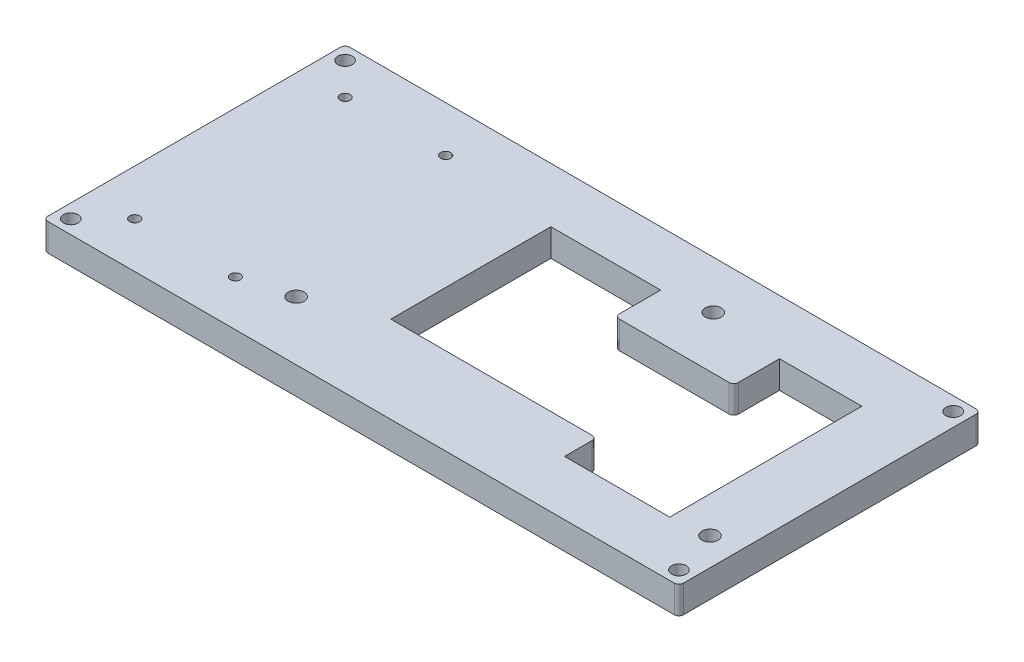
ISO-10303-21;
HEADER;
FILE_DESCRIPTION(('STEP AP214'),'2;1');
FILE_NAME('part.step','',(''),(''),'','','');
FILE_SCHEMA(('AUTOMOTIVE_DESIGN { 1 0 10303 214 1 1 1 1 }'));
ENDSEC;
DATA;
#1=APPLICATION_CONTEXT('core data for automotive mechanical design processes');
#2=APPLICATION_PROTOCOL_DEFINITION('international standard','automotive_design',2000,#1);
#3=PRODUCT_CONTEXT('',#1,'mechanical');
#4=PRODUCT('Part','Part','',(#3));
#5=PRODUCT_RELATED_PRODUCT_CATEGORY('part','',(#4));
#6=PRODUCT_DEFINITION_FORMATION('','',#4);
#7=PRODUCT_DEFINITION_CONTEXT('part definition',#1,'design');
#8=PRODUCT_DEFINITION('design','',#6,#7);
#9=PRODUCT_DEFINITION_SHAPE('','',#8);
#10=(LENGTH_UNIT() NAMED_UNIT(*) SI_UNIT(.MILLI.,.METRE.));
#11=(NAMED_UNIT(*) PLANE_ANGLE_UNIT() SI_UNIT($,.RADIAN.));
#12=(NAMED_UNIT(*) SI_UNIT($,.STERADIAN.) SOLID_ANGLE_UNIT());
#13=UNCERTAINTY_MEASURE_WITH_UNIT(LENGTH_MEASURE(1.E-05),#10,'distance_accuracy_value','');
#14=(GEOMETRIC_REPRESENTATION_CONTEXT(3) GLOBAL_UNCERTAINTY_ASSIGNED_CONTEXT((#13)) GLOBAL_UNIT_ASSIGNED_CONTEXT((#10,
#11,#12)) REPRESENTATION_CONTEXT('',''));
#15=CARTESIAN_POINT('',(0.,0.,0.));
#16=DIRECTION('',(0.,0.,1.));
#17=DIRECTION('',(1.,0.,0.));
#18=AXIS2_PLACEMENT_3D('',#15,#16,#17);
#19=CARTESIAN_POINT('',(91.,6.,-55.5));
#20=DIRECTION('',(0.,-1.,0.));
#21=DIRECTION('',(0.,0.,-1.));
#22=AXIS2_PLACEMENT_3D('',#19,#20,#21);
#23=CYLINDRICAL_SURFACE('',#22,1.75);
#24=CARTESIAN_POINT('',(91.,6.,-55.5));
#25=DIRECTION('',(0.,1.,0.));
#26=DIRECTION('',(0.,0.,1.));
#27=AXIS2_PLACEMENT_3D('',#24,#25,#26);
#28=CIRCLE('',#27,1.75);
#29=CARTESIAN_POINT('',(91.,6.,-53.75));
#30=VERTEX_POINT('',#29);
#31=EDGE_CURVE('E335',#30,#30,#28,.T.);
#32=ORIENTED_EDGE('',*,*,#31,.T.);
#33=EDGE_LOOP('',(#32));
#34=FACE_BOUND('',#33,.T.);
#35=CARTESIAN_POINT('',(91.,3.,-55.5));
#36=DIRECTION('',(0.,-1.,0.));
#37=DIRECTION('',(0.,0.,-1.));
#38=AXIS2_PLACEMENT_3D('',#35,#36,#37);
#39=CIRCLE('',#38,1.75);
#40=CARTESIAN_POINT('',(91.,3.,-57.25));
#41=VERTEX_POINT('',#40);
#42=EDGE_CURVE('E35',#41,#41,#39,.T.);
#43=ORIENTED_EDGE('',*,*,#42,.T.);
#44=EDGE_LOOP('',(#43));
#45=FACE_BOUND('',#44,.T.);
#46=ADVANCED_FACE('F31',(#34,#45),#23,.F.);
#47=CARTESIAN_POINT('',(42.4,6.,-12.9));
#48=DIRECTION('',(0.,-1.,0.));
#49=DIRECTION('',(0.,0.,-1.));
#50=AXIS2_PLACEMENT_3D('',#47,#48,#49);
#51=CYLINDRICAL_SURFACE('',#50,1.75);
#52=CARTESIAN_POINT('',(42.4,6.,-12.9));
#53=DIRECTION('',(0.,1.,0.));
#54=DIRECTION('',(0.,0.,1.));
#55=AXIS2_PLACEMENT_3D('',#52,#53,#54);
#56=CIRCLE('',#55,1.75);
#57=CARTESIAN_POINT('',(42.4,6.,-11.15));
#58=VERTEX_POINT('',#57);
#59=EDGE_CURVE('E387',#58,#58,#56,.T.);
#60=ORIENTED_EDGE('',*,*,#59,.T.);
#61=EDGE_LOOP('',(#60));
#62=FACE_BOUND('',#61,.T.);
#63=CARTESIAN_POINT('',(42.4,3.,-12.9));
#64=DIRECTION('',(0.,-1.,0.));
#65=DIRECTION('',(0.,0.,-1.));
#66=AXIS2_PLACEMENT_3D('',#63,#64,#65);
#67=CIRCLE('',#66,1.75);
#68=CARTESIAN_POINT('',(42.4,3.,-14.65));
#69=VERTEX_POINT('',#68);
#70=EDGE_CURVE('E337',#69,#69,#67,.T.);
#71=ORIENTED_EDGE('',*,*,#70,.T.);
#72=EDGE_LOOP('',(#71));
#73=FACE_BOUND('',#72,.T.);
#74=ADVANCED_FACE('F432',(#62,#73),#51,.F.);
#75=CARTESIAN_POINT('',(132.9,6.,-12.9));
#76=DIRECTION('',(0.,-1.,0.));
#77=DIRECTION('',(0.,0.,-1.));
#78=AXIS2_PLACEMENT_3D('',#75,#76,#77);
#79=CYLINDRICAL_SURFACE('',#78,1.75000000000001);
#80=CARTESIAN_POINT('',(132.9,6.,-12.9));
#81=DIRECTION('',(0.,1.,0.));
#82=DIRECTION('',(0.,0.,1.));
#83=AXIS2_PLACEMENT_3D('',#80,#81,#82);
#84=CIRCLE('',#83,1.75000000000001);
#85=CARTESIAN_POINT('',(132.9,6.,-11.15));
#86=VERTEX_POINT('',#85);
#87=EDGE_CURVE('E382',#86,#86,#84,.T.);
#88=ORIENTED_EDGE('',*,*,#87,.T.);
#89=EDGE_LOOP('',(#88));
#90=FACE_BOUND('',#89,.T.);
#91=CARTESIAN_POINT('',(132.9,3.,-12.9));
#92=DIRECTION('',(0.,-1.,0.));
#93=DIRECTION('',(0.,0.,-1.));
#94=AXIS2_PLACEMENT_3D('',#91,#92,#93);
#95=CIRCLE('',#94,1.75000000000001);
#96=CARTESIAN_POINT('',(132.9,3.,-14.65));
#97=VERTEX_POINT('',#96);
#98=EDGE_CURVE('E333',#97,#97,#95,.T.);
#99=ORIENTED_EDGE('',*,*,#98,.T.);
#100=EDGE_LOOP('',(#99));
#101=FACE_BOUND('',#100,.T.);
#102=ADVANCED_FACE('F438',(#90,#101),#79,.F.);
#103=CARTESIAN_POINT('',(1.,6.,-1.));
#104=DIRECTION('',(0.,-1.,0.));
#105=DIRECTION('',(0.,0.,-1.));
#106=AXIS2_PLACEMENT_3D('',#103,#104,#105);
#107=PLANE('',#106);
#108=CARTESIAN_POINT('',(3.,6.,-63.));
#109=DIRECTION('',(0.,1.,0.));
#110=DIRECTION('',(0.,0.,-1.));
#111=AXIS2_PLACEMENT_3D('',#108,#109,#110);
#112=CIRCLE('',#111,1.6);
#113=CARTESIAN_POINT('',(3.,6.,-64.6));
#114=VERTEX_POINT('',#113);
#115=EDGE_CURVE('E361',#114,#114,#112,.T.);
#116=ORIENTED_EDGE('',*,*,#115,.F.);
#117=EDGE_LOOP('',(#116));
#118=FACE_BOUND('',#117,.T.);
#119=CARTESIAN_POINT('',(3.,6.,-3.));
#120=DIRECTION('',(0.,1.,0.));
#121=DIRECTION('',(0.,0.,1.));
#122=AXIS2_PLACEMENT_3D('',#119,#120,#121);
#123=CIRCLE('',#122,1.6);
#124=CARTESIAN_POINT('',(3.,6.,-1.4));
#125=VERTEX_POINT('',#124);
#126=EDGE_CURVE('E373',#125,#125,#123,.T.);
#127=ORIENTED_EDGE('',*,*,#126,.F.);
#128=EDGE_LOOP('',(#127));
#129=FACE_BOUND('',#128,.T.);
#130=ORIENTED_EDGE('',*,*,#87,.F.);
#131=EDGE_LOOP('',(#130));
#132=FACE_BOUND('',#131,.T.);
#133=CARTESIAN_POINT('',(32.,6.,-56.));
#134=DIRECTION('',(0.,1.,0.));
#135=DIRECTION('',(0.,0.,-1.));
#136=AXIS2_PLACEMENT_3D('',#133,#134,#135);
#137=CIRCLE('',#136,1.1);
#138=CARTESIAN_POINT('',(32.,6.,-57.1));
#139=VERTEX_POINT('',#138);
#140=EDGE_CURVE('E391',#139,#139,#137,.T.);
#141=ORIENTED_EDGE('',*,*,#140,.F.);
#142=EDGE_LOOP('',(#141));
#143=FACE_BOUND('',#142,.T.);
#144=CARTESIAN_POINT('',(10.,6.,-10.));
#145=DIRECTION('',(0.,1.,0.));
#146=DIRECTION('',(0.,0.,1.));
#147=AXIS2_PLACEMENT_3D('',#144,#145,#146);
#148=CIRCLE('',#147,1.1);
#149=CARTESIAN_POINT('',(10.,6.,-8.9));
#150=VERTEX_POINT('',#149);
#151=EDGE_CURVE('E403',#150,#150,#148,.T.);
#152=ORIENTED_EDGE('',*,*,#151,.F.);
#153=EDGE_LOOP('',(#152));
#154=FACE_BOUND('',#153,.T.);
#155=CARTESIAN_POINT('',(101.,6.,-18.));
#156=DIRECTION('',(0.,-1.,0.));
#157=DIRECTION('',(0.,0.,1.));
#158=AXIS2_PLACEMENT_3D('',#155,#156,#157);
#159=CIRCLE('',#158,1.);
#160=CARTESIAN_POINT('',(101.,6.,-19.));
#161=VERTEX_POINT('',#160);
#162=CARTESIAN_POINT('',(102.,6.,-18.));
#163=VERTEX_POINT('',#162);
#164=EDGE_CURVE('E176',#161,#163,#159,.T.);
#165=ORIENTED_EDGE('',*,*,#164,.F.);
#166=DIRECTION('',(1.,0.,0.));
#167=VECTOR('',#166,1.);
#168=CARTESIAN_POINT('',(57.,6.,-19.));
#169=LINE('',#168,#167);
#170=CARTESIAN_POINT('',(57.,6.,-19.));
#171=VERTEX_POINT('',#170);
#172=EDGE_CURVE('E222',#171,#161,#169,.T.);
#173=ORIENTED_EDGE('',*,*,#172,.F.);
#174=DIRECTION('',(0.,0.,1.));
#175=VECTOR('',#174,1.);
#176=CARTESIAN_POINT('',(57.,6.,-19.));
#177=LINE('',#176,#175);
#178=CARTESIAN_POINT('',(57.,6.,-54.));
#179=VERTEX_POINT('',#178);
#180=EDGE_CURVE('E220',#179,#171,#177,.T.);
#181=ORIENTED_EDGE('',*,*,#180,.F.);
#182=DIRECTION('',(-1.,0.,0.));
#183=VECTOR('',#182,1.);
#184=CARTESIAN_POINT('',(81.,6.,-54.));
#185=LINE('',#184,#183);
#186=CARTESIAN_POINT('',(81.,6.,-54.));
#187=VERTEX_POINT('',#186);
#188=EDGE_CURVE('E218',#187,#179,#185,.T.);
#189=ORIENTED_EDGE('',*,*,#188,.F.);
#190=DIRECTION('',(0.,0.,-1.));
#191=VECTOR('',#190,1.);
#192=CARTESIAN_POINT('',(81.,6.,-54.));
#193=LINE('',#192,#191);
#194=CARTESIAN_POINT('',(81.,6.,-45.));
#195=VERTEX_POINT('',#194);
#196=EDGE_CURVE('E216',#195,#187,#193,.T.);
#197=ORIENTED_EDGE('',*,*,#196,.F.);
#198=CARTESIAN_POINT('',(82.,6.,-45.));
#199=DIRECTION('',(0.,-1.,0.));
#200=DIRECTION('',(0.,0.,1.));
#201=AXIS2_PLACEMENT_3D('',#198,#199,#200);
#202=CIRCLE('',#201,1.);
#203=CARTESIAN_POINT('',(82.,6.,-44.));
#204=VERTEX_POINT('',#203);
#205=EDGE_CURVE('E214',#204,#195,#202,.T.);
#206=ORIENTED_EDGE('',*,*,#205,.F.);
#207=DIRECTION('',(-1.,0.,0.));
#208=VECTOR('',#207,1.);
#209=CARTESIAN_POINT('',(82.,6.,-44.));
#210=LINE('',#209,#208);
#211=CARTESIAN_POINT('',(106.,6.,-44.));
#212=VERTEX_POINT('',#211);
#213=EDGE_CURVE('E212',#212,#204,#210,.T.);
#214=ORIENTED_EDGE('',*,*,#213,.F.);
#215=CARTESIAN_POINT('',(106.,6.,-45.));
#216=DIRECTION('',(0.,-1.,0.));
#217=DIRECTION('',(0.,0.,1.));
#218=AXIS2_PLACEMENT_3D('',#215,#216,#217);
#219=CIRCLE('',#218,1.);
#220=CARTESIAN_POINT('',(107.,6.,-45.));
#221=VERTEX_POINT('',#220);
#222=EDGE_CURVE('E210',#221,#212,#219,.T.);
#223=ORIENTED_EDGE('',*,*,#222,.F.);
#224=DIRECTION('',(0.,0.,1.));
#225=VECTOR('',#224,1.);
#226=CARTESIAN_POINT('',(107.,6.,-45.));
#227=LINE('',#226,#225);
#228=CARTESIAN_POINT('',(107.,6.,-54.));
#229=VERTEX_POINT('',#228);
#230=EDGE_CURVE('E208',#229,#221,#227,.T.);
#231=ORIENTED_EDGE('',*,*,#230,.F.);
#232=DIRECTION('',(-1.,0.,0.));
#233=VECTOR('',#232,1.);
#234=CARTESIAN_POINT('',(125.,6.,-54.));
#235=LINE('',#234,#233);
#236=CARTESIAN_POINT('',(125.,6.,-54.));
#237=VERTEX_POINT('',#236);
#238=EDGE_CURVE('E206',#237,#229,#235,.T.);
#239=ORIENTED_EDGE('',*,*,#238,.F.);
#240=DIRECTION('',(0.,0.,-1.));
#241=VECTOR('',#240,1.);
#242=CARTESIAN_POINT('',(125.,6.,-12.));
#243=LINE('',#242,#241);
#244=CARTESIAN_POINT('',(125.,6.,-12.));
#245=VERTEX_POINT('',#244);
#246=EDGE_CURVE('E201',#245,#237,#243,.T.);
#247=ORIENTED_EDGE('',*,*,#246,.F.);
#248=DIRECTION('',(1.,0.,0.));
#249=VECTOR('',#248,1.);
#250=CARTESIAN_POINT('',(125.,6.,-12.));
#251=LINE('',#250,#249);
#252=CARTESIAN_POINT('',(102.,6.,-12.));
#253=VERTEX_POINT('',#252);
#254=EDGE_CURVE('E199',#253,#245,#251,.T.);
#255=ORIENTED_EDGE('',*,*,#254,.F.);
#256=DIRECTION('',(0.,0.,1.));
#257=VECTOR('',#256,1.);
#258=CARTESIAN_POINT('',(102.,6.,-12.));
#259=LINE('',#258,#257);
#260=EDGE_CURVE('E184',#163,#253,#259,.T.);
#261=ORIENTED_EDGE('',*,*,#260,.F.);
#262=EDGE_LOOP('',(#165,#173,#181,#189,#197,#206,#214,#223,#231,#239,#247,#255,#261));
#263=FACE_BOUND('',#262,.T.);
#264=CARTESIAN_POINT('',(1.,6.,-1.));
#265=DIRECTION('',(0.,1.,0.));
#266=DIRECTION('',(0.,0.,-1.));
#267=AXIS2_PLACEMENT_3D('',#264,#265,#266);
#268=CIRCLE('',#267,1.);
#269=CARTESIAN_POINT('',(0.,6.,-1.00000000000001));
#270=VERTEX_POINT('',#269);
#271=CARTESIAN_POINT('',(1.00000000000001,6.,0.));
#272=VERTEX_POINT('',#271);
#273=EDGE_CURVE('E280',#270,#272,#268,.T.);
#274=ORIENTED_EDGE('',*,*,#273,.T.);
#275=DIRECTION('',(1.,0.,0.));
#276=VECTOR('',#275,1.);
#277=CARTESIAN_POINT('',(1.00000000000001,6.,0.));
#278=LINE('',#277,#276);
#279=CARTESIAN_POINT('',(138.,6.,0.));
#280=VERTEX_POINT('',#279);
#281=EDGE_CURVE('E283',#272,#280,#278,.T.);
#282=ORIENTED_EDGE('',*,*,#281,.T.);
#283=CARTESIAN_POINT('',(138.,6.,-1.));
#284=DIRECTION('',(0.,1.,0.));
#285=DIRECTION('',(0.,0.,1.));
#286=AXIS2_PLACEMENT_3D('',#283,#284,#285);
#287=CIRCLE('',#286,1.);
#288=CARTESIAN_POINT('',(139.,6.,-1.00000000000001));
#289=VERTEX_POINT('',#288);
#290=EDGE_CURVE('E286',#280,#289,#287,.T.);
#291=ORIENTED_EDGE('',*,*,#290,.T.);
#292=DIRECTION('',(0.,0.,-1.));
#293=VECTOR('',#292,1.);
#294=CARTESIAN_POINT('',(139.,6.,-1.00000000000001));
#295=LINE('',#294,#293);
#296=CARTESIAN_POINT('',(139.,6.,-65.));
#297=VERTEX_POINT('',#296);
#298=EDGE_CURVE('E288',#289,#297,#295,.T.);
#299=ORIENTED_EDGE('',*,*,#298,.T.);
#300=CARTESIAN_POINT('',(138.,6.,-65.));
#301=DIRECTION('',(0.,1.,0.));
#302=DIRECTION('',(0.,0.,-1.));
#303=AXIS2_PLACEMENT_3D('',#300,#301,#302);
#304=CIRCLE('',#303,1.);
#305=CARTESIAN_POINT('',(138.,6.,-66.));
#306=VERTEX_POINT('',#305);
#307=EDGE_CURVE('E290',#297,#306,#304,.T.);
#308=ORIENTED_EDGE('',*,*,#307,.T.);
#309=DIRECTION('',(-1.,0.,0.));
#310=VECTOR('',#309,1.);
#311=CARTESIAN_POINT('',(1.00000000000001,6.,-66.));
#312=LINE('',#311,#310);
#313=CARTESIAN_POINT('',(1.00000000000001,6.,-66.));
#314=VERTEX_POINT('',#313);
#315=EDGE_CURVE('E292',#306,#314,#312,.T.);
#316=ORIENTED_EDGE('',*,*,#315,.T.);
#317=CARTESIAN_POINT('',(1.,6.,-65.));
#318=DIRECTION('',(0.,1.,0.));
#319=DIRECTION('',(0.,0.,-1.));
#320=AXIS2_PLACEMENT_3D('',#317,#318,#319);
#321=CIRCLE('',#320,1.);
#322=CARTESIAN_POINT('',(0.,6.,-65.));
#323=VERTEX_POINT('',#322);
#324=EDGE_CURVE('E294',#314,#323,#321,.T.);
#325=ORIENTED_EDGE('',*,*,#324,.T.);
#326=DIRECTION('',(0.,0.,1.));
#327=VECTOR('',#326,1.);
#328=CARTESIAN_POINT('',(0.,6.,-1.00000000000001));
#329=LINE('',#328,#327);
#330=EDGE_CURVE('E296',#323,#270,#329,.T.);
#331=ORIENTED_EDGE('',*,*,#330,.T.);
#332=EDGE_LOOP('',(#274,#282,#291,#299,#308,#316,#325,#331));
#333=FACE_BOUND('',#332,.T.);
#334=CARTESIAN_POINT('',(32.,6.,-10.));
#335=DIRECTION('',(0.,1.,0.));
#336=DIRECTION('',(0.,0.,1.));
#337=AXIS2_PLACEMENT_3D('',#334,#335,#336);
#338=CIRCLE('',#337,1.1);
#339=CARTESIAN_POINT('',(32.,6.,-8.9));
#340=VERTEX_POINT('',#339);
#341=EDGE_CURVE('E225',#340,#340,#338,.T.);
#342=ORIENTED_EDGE('',*,*,#341,.F.);
#343=EDGE_LOOP('',(#342));
#344=FACE_BOUND('',#343,.T.);
#345=CARTESIAN_POINT('',(10.,6.,-56.));
#346=DIRECTION('',(0.,1.,0.));
#347=DIRECTION('',(0.,0.,-1.));
#348=AXIS2_PLACEMENT_3D('',#345,#346,#347);
#349=CIRCLE('',#348,1.1);
#350=CARTESIAN_POINT('',(10.,6.,-57.1));
#351=VERTEX_POINT('',#350);
#352=EDGE_CURVE('E397',#351,#351,#349,.T.);
#353=ORIENTED_EDGE('',*,*,#352,.F.);
#354=EDGE_LOOP('',(#353));
#355=FACE_BOUND('',#354,.T.);
#356=ORIENTED_EDGE('',*,*,#59,.F.);
#357=EDGE_LOOP('',(#356));
#358=FACE_BOUND('',#357,.T.);
#359=CARTESIAN_POINT('',(136.,6.,-3.));
#360=DIRECTION('',(0.,1.,0.));
#361=DIRECTION('',(0.,0.,1.));
#362=AXIS2_PLACEMENT_3D('',#359,#360,#361);
#363=CIRCLE('',#362,1.59999999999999);
#364=CARTESIAN_POINT('',(136.,6.,-1.40000000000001));
#365=VERTEX_POINT('',#364);
#366=EDGE_CURVE('E379',#365,#365,#363,.T.);
#367=ORIENTED_EDGE('',*,*,#366,.F.);
#368=EDGE_LOOP('',(#367));
#369=FACE_BOUND('',#368,.T.);
#370=CARTESIAN_POINT('',(136.,6.,-63.));
#371=DIRECTION('',(0.,1.,0.));
#372=DIRECTION('',(0.,0.,-1.));
#373=AXIS2_PLACEMENT_3D('',#370,#371,#372);
#374=CIRCLE('',#373,1.59999999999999);
#375=CARTESIAN_POINT('',(136.,6.,-64.6));
#376=VERTEX_POINT('',#375);
#377=EDGE_CURVE('E367',#376,#376,#374,.T.);
#378=ORIENTED_EDGE('',*,*,#377,.F.);
#379=EDGE_LOOP('',(#378));
#380=FACE_BOUND('',#379,.T.);
#381=ORIENTED_EDGE('',*,*,#31,.F.);
#382=EDGE_LOOP('',(#381));
#383=FACE_BOUND('',#382,.T.);
#384=ADVANCED_FACE('F196',(#118,#129,#132,#143,#154,#263,#333,#344,#355,#358,#369,#380,#383),
#107,.F.);
#385=CARTESIAN_POINT('',(1.,0.,-1.));
#386=DIRECTION('',(0.,-1.,0.));
#387=DIRECTION('',(0.,0.,-1.));
#388=AXIS2_PLACEMENT_3D('',#385,#386,#387);
#389=PLANE('',#388);
#390=CARTESIAN_POINT('',(91.,0.,-55.5));
#391=DIRECTION('',(0.,-1.,0.));
#392=DIRECTION('',(0.,0.,-1.));
#393=AXIS2_PLACEMENT_3D('',#390,#391,#392);
#394=CIRCLE('',#393,3.50000000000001);
#395=CARTESIAN_POINT('',(91.,0.,-59.));
#396=VERTEX_POINT('',#395);
#397=EDGE_CURVE('E353',#396,#396,#394,.T.);
#398=ORIENTED_EDGE('',*,*,#397,.F.);
#399=EDGE_LOOP('',(#398));
#400=FACE_BOUND('',#399,.T.);
#401=CARTESIAN_POINT('',(42.4,0.,-12.9));
#402=DIRECTION('',(0.,-1.,0.));
#403=DIRECTION('',(0.,0.,-1.));
#404=AXIS2_PLACEMENT_3D('',#401,#402,#403);
#405=CIRCLE('',#404,3.5);
#406=CARTESIAN_POINT('',(42.4,0.,-16.4));
#407=VERTEX_POINT('',#406);
#408=EDGE_CURVE('E346',#407,#407,#405,.T.);
#409=ORIENTED_EDGE('',*,*,#408,.F.);
#410=EDGE_LOOP('',(#409));
#411=FACE_BOUND('',#410,.T.);
#412=CARTESIAN_POINT('',(132.9,0.,-12.9));
#413=DIRECTION('',(0.,-1.,0.));
#414=DIRECTION('',(0.,0.,-1.));
#415=AXIS2_PLACEMENT_3D('',#412,#413,#414);
#416=CIRCLE('',#415,3.49999999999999);
#417=CARTESIAN_POINT('',(132.9,0.,-16.4));
#418=VERTEX_POINT('',#417);
#419=EDGE_CURVE('E339',#418,#418,#416,.T.);
#420=ORIENTED_EDGE('',*,*,#419,.F.);
#421=EDGE_LOOP('',(#420));
#422=FACE_BOUND('',#421,.T.);
#423=CARTESIAN_POINT('',(3.,0.,-63.));
#424=DIRECTION('',(0.,1.,0.));
#425=DIRECTION('',(0.,0.,-1.));
#426=AXIS2_PLACEMENT_3D('',#423,#424,#425);
#427=CIRCLE('',#426,1.6);
#428=CARTESIAN_POINT('',(3.,0.,-64.6));
#429=VERTEX_POINT('',#428);
#430=EDGE_CURVE('E360',#429,#429,#427,.T.);
#431=ORIENTED_EDGE('',*,*,#430,.T.);
#432=EDGE_LOOP('',(#431));
#433=FACE_BOUND('',#432,.T.);
#434=CARTESIAN_POINT('',(3.,0.,-3.));
#435=DIRECTION('',(0.,1.,0.));
#436=DIRECTION('',(0.,0.,1.));
#437=AXIS2_PLACEMENT_3D('',#434,#435,#436);
#438=CIRCLE('',#437,1.6);
#439=CARTESIAN_POINT('',(3.,0.,-1.4));
#440=VERTEX_POINT('',#439);
#441=EDGE_CURVE('E370',#440,#440,#438,.T.);
#442=ORIENTED_EDGE('',*,*,#441,.T.);
#443=EDGE_LOOP('',(#442));
#444=FACE_BOUND('',#443,.T.);
#445=CARTESIAN_POINT('',(32.,0.,-56.));
#446=DIRECTION('',(0.,1.,0.));
#447=DIRECTION('',(0.,0.,-1.));
#448=AXIS2_PLACEMENT_3D('',#445,#446,#447);
#449=CIRCLE('',#448,1.1);
#450=CARTESIAN_POINT('',(32.,0.,-57.1));
#451=VERTEX_POINT('',#450);
#452=EDGE_CURVE('E390',#451,#451,#449,.T.);
#453=ORIENTED_EDGE('',*,*,#452,.T.);
#454=EDGE_LOOP('',(#453));
#455=FACE_BOUND('',#454,.T.);
#456=CARTESIAN_POINT('',(10.,0.,-10.));
#457=DIRECTION('',(0.,1.,0.));
#458=DIRECTION('',(0.,0.,1.));
#459=AXIS2_PLACEMENT_3D('',#456,#457,#458);
#460=CIRCLE('',#459,1.1);
#461=CARTESIAN_POINT('',(10.,0.,-8.9));
#462=VERTEX_POINT('',#461);
#463=EDGE_CURVE('E400',#462,#462,#460,.T.);
#464=ORIENTED_EDGE('',*,*,#463,.T.);
#465=EDGE_LOOP('',(#464));
#466=FACE_BOUND('',#465,.T.);
#467=DIRECTION('',(1.,0.,0.));
#468=VECTOR('',#467,1.);
#469=CARTESIAN_POINT('',(57.,0.,-19.));
#470=LINE('',#469,#468);
#471=CARTESIAN_POINT('',(57.,0.,-19.));
#472=VERTEX_POINT('',#471);
#473=CARTESIAN_POINT('',(101.,0.,-19.));
#474=VERTEX_POINT('',#473);
#475=EDGE_CURVE('E185',#472,#474,#470,.T.);
#476=ORIENTED_EDGE('',*,*,#475,.T.);
#477=CARTESIAN_POINT('',(101.,0.,-18.));
#478=DIRECTION('',(0.,-1.,0.));
#479=DIRECTION('',(0.,0.,1.));
#480=AXIS2_PLACEMENT_3D('',#477,#478,#479);
#481=CIRCLE('',#480,1.);
#482=CARTESIAN_POINT('',(102.,0.,-18.));
#483=VERTEX_POINT('',#482);
#484=EDGE_CURVE('E56',#474,#483,#481,.T.);
#485=ORIENTED_EDGE('',*,*,#484,.T.);
#486=DIRECTION('',(0.,0.,1.));
#487=VECTOR('',#486,1.);
#488=CARTESIAN_POINT('',(102.,0.,-12.));
#489=LINE('',#488,#487);
#490=CARTESIAN_POINT('',(102.,0.,-12.));
#491=VERTEX_POINT('',#490);
#492=EDGE_CURVE('E191',#483,#491,#489,.T.);
#493=ORIENTED_EDGE('',*,*,#492,.T.);
#494=DIRECTION('',(1.,0.,0.));
#495=VECTOR('',#494,1.);
#496=CARTESIAN_POINT('',(125.,0.,-12.));
#497=LINE('',#496,#495);
#498=CARTESIAN_POINT('',(125.,0.,-12.));
#499=VERTEX_POINT('',#498);
#500=EDGE_CURVE('E227',#491,#499,#497,.T.);
#501=ORIENTED_EDGE('',*,*,#500,.T.);
#502=DIRECTION('',(0.,0.,-1.));
#503=VECTOR('',#502,1.);
#504=CARTESIAN_POINT('',(125.,0.,-12.));
#505=LINE('',#504,#503);
#506=CARTESIAN_POINT('',(125.,0.,-54.));
#507=VERTEX_POINT('',#506);
#508=EDGE_CURVE('E230',#499,#507,#505,.T.);
#509=ORIENTED_EDGE('',*,*,#508,.T.);
#510=DIRECTION('',(-1.,0.,0.));
#511=VECTOR('',#510,1.);
#512=CARTESIAN_POINT('',(125.,0.,-54.));
#513=LINE('',#512,#511);
#514=CARTESIAN_POINT('',(107.,0.,-54.));
#515=VERTEX_POINT('',#514);
#516=EDGE_CURVE('E233',#507,#515,#513,.T.);
#517=ORIENTED_EDGE('',*,*,#516,.T.);
#518=DIRECTION('',(0.,0.,1.));
#519=VECTOR('',#518,1.);
#520=CARTESIAN_POINT('',(107.,0.,-45.));
#521=LINE('',#520,#519);
#522=CARTESIAN_POINT('',(107.,0.,-45.));
#523=VERTEX_POINT('',#522);
#524=EDGE_CURVE('E236',#515,#523,#521,.T.);
#525=ORIENTED_EDGE('',*,*,#524,.T.);
#526=CARTESIAN_POINT('',(106.,0.,-45.));
#527=DIRECTION('',(0.,-1.,0.));
#528=DIRECTION('',(0.,0.,1.));
#529=AXIS2_PLACEMENT_3D('',#526,#527,#528);
#530=CIRCLE('',#529,1.);
#531=CARTESIAN_POINT('',(106.,0.,-44.));
#532=VERTEX_POINT('',#531);
#533=EDGE_CURVE('E239',#523,#532,#530,.T.);
#534=ORIENTED_EDGE('',*,*,#533,.T.);
#535=DIRECTION('',(-1.,0.,0.));
#536=VECTOR('',#535,1.);
#537=CARTESIAN_POINT('',(82.,0.,-44.));
#538=LINE('',#537,#536);
#539=CARTESIAN_POINT('',(82.,0.,-44.));
#540=VERTEX_POINT('',#539);
#541=EDGE_CURVE('E242',#532,#540,#538,.T.);
#542=ORIENTED_EDGE('',*,*,#541,.T.);
#543=CARTESIAN_POINT('',(82.,0.,-45.));
#544=DIRECTION('',(0.,-1.,0.));
#545=DIRECTION('',(0.,0.,1.));
#546=AXIS2_PLACEMENT_3D('',#543,#544,#545);
#547=CIRCLE('',#546,1.);
#548=CARTESIAN_POINT('',(81.,0.,-45.));
#549=VERTEX_POINT('',#548);
#550=EDGE_CURVE('E245',#540,#549,#547,.T.);
#551=ORIENTED_EDGE('',*,*,#550,.T.);
#552=DIRECTION('',(0.,0.,-1.));
#553=VECTOR('',#552,1.);
#554=CARTESIAN_POINT('',(81.,0.,-54.));
#555=LINE('',#554,#553);
#556=CARTESIAN_POINT('',(81.,0.,-54.));
#557=VERTEX_POINT('',#556);
#558=EDGE_CURVE('E248',#549,#557,#555,.T.);
#559=ORIENTED_EDGE('',*,*,#558,.T.);
#560=DIRECTION('',(-1.,0.,0.));
#561=VECTOR('',#560,1.);
#562=CARTESIAN_POINT('',(81.,0.,-54.));
#563=LINE('',#562,#561);
#564=CARTESIAN_POINT('',(57.,0.,-54.));
#565=VERTEX_POINT('',#564);
#566=EDGE_CURVE('E251',#557,#565,#563,.T.);
#567=ORIENTED_EDGE('',*,*,#566,.T.);
#568=DIRECTION('',(0.,0.,1.));
#569=VECTOR('',#568,1.);
#570=CARTESIAN_POINT('',(57.,0.,-19.));
#571=LINE('',#570,#569);
#572=EDGE_CURVE('E254',#565,#472,#571,.T.);
#573=ORIENTED_EDGE('',*,*,#572,.T.);
#574=EDGE_LOOP('',(#476,#485,#493,#501,#509,#517,#525,#534,#542,#551,#559,#567,#573));
#575=FACE_BOUND('',#574,.T.);
#576=CARTESIAN_POINT('',(1.,0.,-1.));
#577=DIRECTION('',(0.,1.,0.));
#578=DIRECTION('',(0.,0.,-1.));
#579=AXIS2_PLACEMENT_3D('',#576,#577,#578);
#580=CIRCLE('',#579,1.);
#581=CARTESIAN_POINT('',(0.,0.,-1.00000000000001));
#582=VERTEX_POINT('',#581);
#583=CARTESIAN_POINT('',(1.00000000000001,0.,0.));
#584=VERTEX_POINT('',#583);
#585=EDGE_CURVE('E192',#582,#584,#580,.T.);
#586=ORIENTED_EDGE('',*,*,#585,.F.);
#587=DIRECTION('',(0.,0.,1.));
#588=VECTOR('',#587,1.);
#589=CARTESIAN_POINT('',(0.,0.,-1.00000000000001));
#590=LINE('',#589,#588);
#591=CARTESIAN_POINT('',(0.,0.,-65.));
#592=VERTEX_POINT('',#591);
#593=EDGE_CURVE('E284',#592,#582,#590,.T.);
#594=ORIENTED_EDGE('',*,*,#593,.F.);
#595=CARTESIAN_POINT('',(1.,0.,-65.));
#596=DIRECTION('',(0.,1.,0.));
#597=DIRECTION('',(0.,0.,-1.));
#598=AXIS2_PLACEMENT_3D('',#595,#596,#597);
#599=CIRCLE('',#598,1.);
#600=CARTESIAN_POINT('',(1.00000000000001,0.,-66.));
#601=VERTEX_POINT('',#600);
#602=EDGE_CURVE('E311',#601,#592,#599,.T.);
#603=ORIENTED_EDGE('',*,*,#602,.F.);
#604=DIRECTION('',(-1.,0.,0.));
#605=VECTOR('',#604,1.);
#606=CARTESIAN_POINT('',(1.00000000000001,0.,-66.));
#607=LINE('',#606,#605);
#608=CARTESIAN_POINT('',(138.,0.,-66.));
#609=VERTEX_POINT('',#608);
#610=EDGE_CURVE('E309',#609,#601,#607,.T.);
#611=ORIENTED_EDGE('',*,*,#610,.F.);
#612=CARTESIAN_POINT('',(138.,0.,-65.));
#613=DIRECTION('',(0.,1.,0.));
#614=DIRECTION('',(0.,0.,-1.));
#615=AXIS2_PLACEMENT_3D('',#612,#613,#614);
#616=CIRCLE('',#615,1.);
#617=CARTESIAN_POINT('',(139.,0.,-65.));
#618=VERTEX_POINT('',#617);
#619=EDGE_CURVE('E307',#618,#609,#616,.T.);
#620=ORIENTED_EDGE('',*,*,#619,.F.);
#621=DIRECTION('',(0.,0.,-1.));
#622=VECTOR('',#621,1.);
#623=CARTESIAN_POINT('',(139.,0.,-1.00000000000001));
#624=LINE('',#623,#622);
#625=CARTESIAN_POINT('',(139.,0.,-1.00000000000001));
#626=VERTEX_POINT('',#625);
#627=EDGE_CURVE('E305',#626,#618,#624,.T.);
#628=ORIENTED_EDGE('',*,*,#627,.F.);
#629=CARTESIAN_POINT('',(138.,0.,-1.));
#630=DIRECTION('',(0.,1.,0.));
#631=DIRECTION('',(0.,0.,1.));
#632=AXIS2_PLACEMENT_3D('',#629,#630,#631);
#633=CIRCLE('',#632,1.);
#634=CARTESIAN_POINT('',(138.,0.,0.));
#635=VERTEX_POINT('',#634);
#636=EDGE_CURVE('E303',#635,#626,#633,.T.);
#637=ORIENTED_EDGE('',*,*,#636,.F.);
#638=DIRECTION('',(1.,0.,0.));
#639=VECTOR('',#638,1.);
#640=CARTESIAN_POINT('',(1.00000000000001,0.,0.));
#641=LINE('',#640,#639);
#642=EDGE_CURVE('E301',#584,#635,#641,.T.);
#643=ORIENTED_EDGE('',*,*,#642,.F.);
#644=EDGE_LOOP('',(#586,#594,#603,#611,#620,#628,#637,#643));
#645=FACE_BOUND('',#644,.T.);
#646=CARTESIAN_POINT('',(32.,0.,-10.));
#647=DIRECTION('',(0.,1.,0.));
#648=DIRECTION('',(0.,0.,1.));
#649=AXIS2_PLACEMENT_3D('',#646,#647,#648);
#650=CIRCLE('',#649,1.1);
#651=CARTESIAN_POINT('',(32.,0.,-8.9));
#652=VERTEX_POINT('',#651);
#653=EDGE_CURVE('E406',#652,#652,#650,.T.);
#654=ORIENTED_EDGE('',*,*,#653,.T.);
#655=EDGE_LOOP('',(#654));
#656=FACE_BOUND('',#655,.T.);
#657=CARTESIAN_POINT('',(10.,0.,-56.));
#658=DIRECTION('',(0.,1.,0.));
#659=DIRECTION('',(0.,0.,-1.));
#660=AXIS2_PLACEMENT_3D('',#657,#658,#659);
#661=CIRCLE('',#660,1.1);
#662=CARTESIAN_POINT('',(10.,0.,-57.1));
#663=VERTEX_POINT('',#662);
#664=EDGE_CURVE('E394',#663,#663,#661,.T.);
#665=ORIENTED_EDGE('',*,*,#664,.T.);
#666=EDGE_LOOP('',(#665));
#667=FACE_BOUND('',#666,.T.);
#668=CARTESIAN_POINT('',(136.,0.,-3.));
#669=DIRECTION('',(0.,1.,0.));
#670=DIRECTION('',(0.,0.,1.));
#671=AXIS2_PLACEMENT_3D('',#668,#669,#670);
#672=CIRCLE('',#671,1.59999999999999);
#673=CARTESIAN_POINT('',(136.,0.,-1.40000000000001));
#674=VERTEX_POINT('',#673);
#675=EDGE_CURVE('E376',#674,#674,#672,.T.);
#676=ORIENTED_EDGE('',*,*,#675,.T.);
#677=EDGE_LOOP('',(#676));
#678=FACE_BOUND('',#677,.T.);
#679=CARTESIAN_POINT('',(136.,0.,-63.));
#680=DIRECTION('',(0.,1.,0.));
#681=DIRECTION('',(0.,0.,-1.));
#682=AXIS2_PLACEMENT_3D('',#679,#680,#681);
#683=CIRCLE('',#682,1.59999999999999);
#684=CARTESIAN_POINT('',(136.,0.,-64.6));
#685=VERTEX_POINT('',#684);
#686=EDGE_CURVE('E364',#685,#685,#683,.T.);
#687=ORIENTED_EDGE('',*,*,#686,.T.);
#688=EDGE_LOOP('',(#687));
#689=FACE_BOUND('',#688,.T.);
#690=ADVANCED_FACE('F413',(#400,#411,#422,#433,#444,#455,#466,#575,#645,#656,#667,#678,#689),
#389,.T.);
#691=CARTESIAN_POINT('',(1.,6.,-1.));
#692=DIRECTION('',(0.,-1.,0.));
#693=DIRECTION('',(0.,0.,-1.));
#694=AXIS2_PLACEMENT_3D('',#691,#692,#693);
#695=CYLINDRICAL_SURFACE('',#694,1.);
#696=ORIENTED_EDGE('',*,*,#585,.T.);
#697=DIRECTION('',(0.,-1.,0.));
#698=VECTOR('',#697,1.);
#699=CARTESIAN_POINT('',(1.00000000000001,6.,0.));
#700=LINE('',#699,#698);
#701=EDGE_CURVE('E11',#272,#584,#700,.T.);
#702=ORIENTED_EDGE('',*,*,#701,.F.);
#703=ORIENTED_EDGE('',*,*,#273,.F.);
#704=DIRECTION('',(0.,-1.,0.));
#705=VECTOR('',#704,1.);
#706=CARTESIAN_POINT('',(0.,6.,-1.00000000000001));
#707=LINE('',#706,#705);
#708=EDGE_CURVE('E298',#270,#582,#707,.T.);
#709=ORIENTED_EDGE('',*,*,#708,.T.);
#710=EDGE_LOOP('',(#696,#702,#703,#709));
#711=FACE_BOUND('',#710,.T.);
#712=ADVANCED_FACE('F33',(#711),#695,.T.);
#713=CARTESIAN_POINT('',(1.00000000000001,6.,0.));
#714=DIRECTION('',(0.,0.,-1.));
#715=DIRECTION('',(-1.,0.,0.));
#716=AXIS2_PLACEMENT_3D('',#713,#714,#715);
#717=PLANE('',#716);
#718=ORIENTED_EDGE('',*,*,#642,.T.);
#719=DIRECTION('',(0.,-1.,0.));
#720=VECTOR('',#719,1.);
#721=CARTESIAN_POINT('',(138.,6.,0.));
#722=LINE('',#721,#720);
#723=EDGE_CURVE('E40',#280,#635,#722,.T.);
#724=ORIENTED_EDGE('',*,*,#723,.F.);
#725=ORIENTED_EDGE('',*,*,#281,.F.);
#726=ORIENTED_EDGE('',*,*,#701,.T.);
#727=EDGE_LOOP('',(#718,#724,#725,#726));
#728=FACE_BOUND('',#727,.T.);
#729=ADVANCED_FACE('F489',(#728),#717,.F.);
#730=CARTESIAN_POINT('',(138.,6.,-1.));
#731=DIRECTION('',(0.,-1.,0.));
#732=DIRECTION('',(0.,0.,-1.));
#733=AXIS2_PLACEMENT_3D('',#730,#731,#732);
#734=CYLINDRICAL_SURFACE('',#733,1.);
#735=ORIENTED_EDGE('',*,*,#636,.T.);
#736=DIRECTION('',(0.,-1.,0.));
#737=VECTOR('',#736,1.);
#738=CARTESIAN_POINT('',(139.,6.,-1.00000000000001));
#739=LINE('',#738,#737);
#740=EDGE_CURVE('E328',#289,#626,#739,.T.);
#741=ORIENTED_EDGE('',*,*,#740,.F.);
#742=ORIENTED_EDGE('',*,*,#290,.F.);
#743=ORIENTED_EDGE('',*,*,#723,.T.);
#744=EDGE_LOOP('',(#735,#741,#742,#743));
#745=FACE_BOUND('',#744,.T.);
#746=ADVANCED_FACE('F516',(#745),#734,.T.);
#747=CARTESIAN_POINT('',(139.,6.,-1.00000000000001));
#748=DIRECTION('',(-1.,0.,0.));
#749=DIRECTION('',(0.,0.,1.));
#750=AXIS2_PLACEMENT_3D('',#747,#748,#749);
#751=PLANE('',#750);
#752=ORIENTED_EDGE('',*,*,#627,.T.);
#753=DIRECTION('',(0.,-1.,0.));
#754=VECTOR('',#753,1.);
#755=CARTESIAN_POINT('',(139.,6.,-65.));
#756=LINE('',#755,#754);
#757=EDGE_CURVE('E325',#297,#618,#756,.T.);
#758=ORIENTED_EDGE('',*,*,#757,.F.);
#759=ORIENTED_EDGE('',*,*,#298,.F.);
#760=ORIENTED_EDGE('',*,*,#740,.T.);
#761=EDGE_LOOP('',(#752,#758,#759,#760));
#762=FACE_BOUND('',#761,.T.);
#763=ADVANCED_FACE('F512',(#762),#751,.F.);
#764=CARTESIAN_POINT('',(138.,6.,-65.));
#765=DIRECTION('',(0.,-1.,0.));
#766=DIRECTION('',(0.,0.,-1.));
#767=AXIS2_PLACEMENT_3D('',#764,#765,#766);
#768=CYLINDRICAL_SURFACE('',#767,1.);
#769=ORIENTED_EDGE('',*,*,#619,.T.);
#770=DIRECTION('',(0.,-1.,0.));
#771=VECTOR('',#770,1.);
#772=CARTESIAN_POINT('',(138.,6.,-66.));
#773=LINE('',#772,#771);
#774=EDGE_CURVE('E322',#306,#609,#773,.T.);
#775=ORIENTED_EDGE('',*,*,#774,.F.);
#776=ORIENTED_EDGE('',*,*,#307,.F.);
#777=ORIENTED_EDGE('',*,*,#757,.T.);
#778=EDGE_LOOP('',(#769,#775,#776,#777));
#779=FACE_BOUND('',#778,.T.);
#780=ADVANCED_FACE('F508',(#779),#768,.T.);
#781=CARTESIAN_POINT('',(1.00000000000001,6.,-66.));
#782=DIRECTION('',(0.,0.,1.));
#783=DIRECTION('',(1.,0.,0.));
#784=AXIS2_PLACEMENT_3D('',#781,#782,#783);
#785=PLANE('',#784);
#786=ORIENTED_EDGE('',*,*,#610,.T.);
#787=DIRECTION('',(0.,-1.,0.));
#788=VECTOR('',#787,1.);
#789=CARTESIAN_POINT('',(1.00000000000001,6.,-66.));
#790=LINE('',#789,#788);
#791=EDGE_CURVE('E319',#314,#601,#790,.T.);
#792=ORIENTED_EDGE('',*,*,#791,.F.);
#793=ORIENTED_EDGE('',*,*,#315,.F.);
#794=ORIENTED_EDGE('',*,*,#774,.T.);
#795=EDGE_LOOP('',(#786,#792,#793,#794));
#796=FACE_BOUND('',#795,.T.);
#797=ADVANCED_FACE('F504',(#796),#785,.F.);
#798=CARTESIAN_POINT('',(1.,6.,-65.));
#799=DIRECTION('',(0.,-1.,0.));
#800=DIRECTION('',(0.,0.,-1.));
#801=AXIS2_PLACEMENT_3D('',#798,#799,#800);
#802=CYLINDRICAL_SURFACE('',#801,1.);
#803=ORIENTED_EDGE('',*,*,#602,.T.);
#804=DIRECTION('',(0.,-1.,0.));
#805=VECTOR('',#804,1.);
#806=CARTESIAN_POINT('',(0.,6.,-65.));
#807=LINE('',#806,#805);
#808=EDGE_CURVE('E316',#323,#592,#807,.T.);
#809=ORIENTED_EDGE('',*,*,#808,.F.);
#810=ORIENTED_EDGE('',*,*,#324,.F.);
#811=ORIENTED_EDGE('',*,*,#791,.T.);
#812=EDGE_LOOP('',(#803,#809,#810,#811));
#813=FACE_BOUND('',#812,.T.);
#814=ADVANCED_FACE('F500',(#813),#802,.T.);
#815=CARTESIAN_POINT('',(0.,6.,-1.00000000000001));
#816=DIRECTION('',(1.,0.,0.));
#817=DIRECTION('',(0.,0.,-1.));
#818=AXIS2_PLACEMENT_3D('',#815,#816,#817);
#819=PLANE('',#818);
#820=ORIENTED_EDGE('',*,*,#593,.T.);
#821=ORIENTED_EDGE('',*,*,#708,.F.);
#822=ORIENTED_EDGE('',*,*,#330,.F.);
#823=ORIENTED_EDGE('',*,*,#808,.T.);
#824=EDGE_LOOP('',(#820,#821,#822,#823));
#825=FACE_BOUND('',#824,.T.);
#826=ADVANCED_FACE('F497',(#825),#819,.F.);
#827=CARTESIAN_POINT('',(101.,6.,-18.));
#828=DIRECTION('',(0.,-1.,0.));
#829=DIRECTION('',(0.,0.,-1.));
#830=AXIS2_PLACEMENT_3D('',#827,#828,#829);
#831=CYLINDRICAL_SURFACE('',#830,1.);
#832=ORIENTED_EDGE('',*,*,#484,.F.);
#833=DIRECTION('',(0.,-1.,0.));
#834=VECTOR('',#833,1.);
#835=CARTESIAN_POINT('',(101.,6.,-19.));
#836=LINE('',#835,#834);
#837=EDGE_CURVE('E180',#161,#474,#836,.T.);
#838=ORIENTED_EDGE('',*,*,#837,.F.);
#839=ORIENTED_EDGE('',*,*,#164,.T.);
#840=DIRECTION('',(0.,-1.,0.));
#841=VECTOR('',#840,1.);
#842=CARTESIAN_POINT('',(102.,6.,-18.));
#843=LINE('',#842,#841);
#844=EDGE_CURVE('E179',#163,#483,#843,.T.);
#845=ORIENTED_EDGE('',*,*,#844,.T.);
#846=EDGE_LOOP('',(#832,#838,#839,#845));
#847=FACE_BOUND('',#846,.T.);
#848=ADVANCED_FACE('F178',(#847),#831,.T.);
#849=CARTESIAN_POINT('',(102.,6.,-12.));
#850=DIRECTION('',(1.,0.,0.));
#851=DIRECTION('',(0.,0.,-1.));
#852=AXIS2_PLACEMENT_3D('',#849,#850,#851);
#853=PLANE('',#852);
#854=ORIENTED_EDGE('',*,*,#492,.F.);
#855=ORIENTED_EDGE('',*,*,#844,.F.);
#856=ORIENTED_EDGE('',*,*,#260,.T.);
#857=DIRECTION('',(0.,-1.,0.));
#858=VECTOR('',#857,1.);
#859=CARTESIAN_POINT('',(102.,6.,-12.));
#860=LINE('',#859,#858);
#861=EDGE_CURVE('E193',#253,#491,#860,.T.);
#862=ORIENTED_EDGE('',*,*,#861,.T.);
#863=EDGE_LOOP('',(#854,#855,#856,#862));
#864=FACE_BOUND('',#863,.T.);
#865=ADVANCED_FACE('F188',(#864),#853,.T.);
#866=CARTESIAN_POINT('',(125.,6.,-12.));
#867=DIRECTION('',(0.,0.,-1.));
#868=DIRECTION('',(-1.,0.,0.));
#869=AXIS2_PLACEMENT_3D('',#866,#867,#868);
#870=PLANE('',#869);
#871=ORIENTED_EDGE('',*,*,#500,.F.);
#872=ORIENTED_EDGE('',*,*,#861,.F.);
#873=ORIENTED_EDGE('',*,*,#254,.T.);
#874=DIRECTION('',(0.,-1.,0.));
#875=VECTOR('',#874,1.);
#876=CARTESIAN_POINT('',(125.,6.,-12.));
#877=LINE('',#876,#875);
#878=EDGE_CURVE('E277',#245,#499,#877,.T.);
#879=ORIENTED_EDGE('',*,*,#878,.T.);
#880=EDGE_LOOP('',(#871,#872,#873,#879));
#881=FACE_BOUND('',#880,.T.);
#882=ADVANCED_FACE('F595',(#881),#870,.T.);
#883=CARTESIAN_POINT('',(125.,6.,-12.));
#884=DIRECTION('',(-1.,0.,0.));
#885=DIRECTION('',(0.,0.,1.));
#886=AXIS2_PLACEMENT_3D('',#883,#884,#885);
#887=PLANE('',#886);
#888=ORIENTED_EDGE('',*,*,#508,.F.);
#889=ORIENTED_EDGE('',*,*,#878,.F.);
#890=ORIENTED_EDGE('',*,*,#246,.T.);
#891=DIRECTION('',(0.,-1.,0.));
#892=VECTOR('',#891,1.);
#893=CARTESIAN_POINT('',(125.,6.,-54.));
#894=LINE('',#893,#892);
#895=EDGE_CURVE('E275',#237,#507,#894,.T.);
#896=ORIENTED_EDGE('',*,*,#895,.T.);
#897=EDGE_LOOP('',(#888,#889,#890,#896));
#898=FACE_BOUND('',#897,.T.);
#899=ADVANCED_FACE('F602',(#898),#887,.T.);
#900=CARTESIAN_POINT('',(125.,6.,-54.));
#901=DIRECTION('',(0.,0.,1.));
#902=DIRECTION('',(1.,0.,0.));
#903=AXIS2_PLACEMENT_3D('',#900,#901,#902);
#904=PLANE('',#903);
#905=ORIENTED_EDGE('',*,*,#516,.F.);
#906=ORIENTED_EDGE('',*,*,#895,.F.);
#907=ORIENTED_EDGE('',*,*,#238,.T.);
#908=DIRECTION('',(0.,-1.,0.));
#909=VECTOR('',#908,1.);
#910=CARTESIAN_POINT('',(107.,6.,-54.));
#911=LINE('',#910,#909);
#912=EDGE_CURVE('E273',#229,#515,#911,.T.);
#913=ORIENTED_EDGE('',*,*,#912,.T.);
#914=EDGE_LOOP('',(#905,#906,#907,#913));
#915=FACE_BOUND('',#914,.T.);
#916=ADVANCED_FACE('F610',(#915),#904,.T.);
#917=CARTESIAN_POINT('',(107.,6.,-45.));
#918=DIRECTION('',(1.,0.,0.));
#919=DIRECTION('',(0.,0.,-1.));
#920=AXIS2_PLACEMENT_3D('',#917,#918,#919);
#921=PLANE('',#920);
#922=ORIENTED_EDGE('',*,*,#524,.F.);
#923=ORIENTED_EDGE('',*,*,#912,.F.);
#924=ORIENTED_EDGE('',*,*,#230,.T.);
#925=DIRECTION('',(0.,-1.,0.));
#926=VECTOR('',#925,1.);
#927=CARTESIAN_POINT('',(107.,6.,-45.));
#928=LINE('',#927,#926);
#929=EDGE_CURVE('E271',#221,#523,#928,.T.);
#930=ORIENTED_EDGE('',*,*,#929,.T.);
#931=EDGE_LOOP('',(#922,#923,#924,#930));
#932=FACE_BOUND('',#931,.T.);
#933=ADVANCED_FACE('F618',(#932),#921,.T.);
#934=CARTESIAN_POINT('',(106.,6.,-45.));
#935=DIRECTION('',(0.,-1.,0.));
#936=DIRECTION('',(0.,0.,-1.));
#937=AXIS2_PLACEMENT_3D('',#934,#935,#936);
#938=CYLINDRICAL_SURFACE('',#937,1.);
#939=ORIENTED_EDGE('',*,*,#533,.F.);
#940=ORIENTED_EDGE('',*,*,#929,.F.);
#941=ORIENTED_EDGE('',*,*,#222,.T.);
#942=DIRECTION('',(0.,-1.,0.));
#943=VECTOR('',#942,1.);
#944=CARTESIAN_POINT('',(106.,6.,-44.));
#945=LINE('',#944,#943);
#946=EDGE_CURVE('E269',#212,#532,#945,.T.);
#947=ORIENTED_EDGE('',*,*,#946,.T.);
#948=EDGE_LOOP('',(#939,#940,#941,#947));
#949=FACE_BOUND('',#948,.T.);
#950=ADVANCED_FACE('F626',(#949),#938,.T.);
#951=CARTESIAN_POINT('',(82.,6.,-44.));
#952=DIRECTION('',(0.,0.,1.));
#953=DIRECTION('',(1.,0.,0.));
#954=AXIS2_PLACEMENT_3D('',#951,#952,#953);
#955=PLANE('',#954);
#956=ORIENTED_EDGE('',*,*,#541,.F.);
#957=ORIENTED_EDGE('',*,*,#946,.F.);
#958=ORIENTED_EDGE('',*,*,#213,.T.);
#959=DIRECTION('',(0.,-1.,0.));
#960=VECTOR('',#959,1.);
#961=CARTESIAN_POINT('',(82.,6.,-44.));
#962=LINE('',#961,#960);
#963=EDGE_CURVE('E267',#204,#540,#962,.T.);
#964=ORIENTED_EDGE('',*,*,#963,.T.);
#965=EDGE_LOOP('',(#956,#957,#958,#964));
#966=FACE_BOUND('',#965,.T.);
#967=ADVANCED_FACE('F634',(#966),#955,.T.);
#968=CARTESIAN_POINT('',(82.,6.,-45.));
#969=DIRECTION('',(0.,-1.,0.));
#970=DIRECTION('',(0.,0.,-1.));
#971=AXIS2_PLACEMENT_3D('',#968,#969,#970);
#972=CYLINDRICAL_SURFACE('',#971,1.);
#973=ORIENTED_EDGE('',*,*,#550,.F.);
#974=ORIENTED_EDGE('',*,*,#963,.F.);
#975=ORIENTED_EDGE('',*,*,#205,.T.);
#976=DIRECTION('',(0.,-1.,0.));
#977=VECTOR('',#976,1.);
#978=CARTESIAN_POINT('',(81.,6.,-45.));
#979=LINE('',#978,#977);
#980=EDGE_CURVE('E265',#195,#549,#979,.T.);
#981=ORIENTED_EDGE('',*,*,#980,.T.);
#982=EDGE_LOOP('',(#973,#974,#975,#981));
#983=FACE_BOUND('',#982,.T.);
#984=ADVANCED_FACE('F642',(#983),#972,.T.);
#985=CARTESIAN_POINT('',(81.,6.,-54.));
#986=DIRECTION('',(-1.,0.,0.));
#987=DIRECTION('',(0.,0.,1.));
#988=AXIS2_PLACEMENT_3D('',#985,#986,#987);
#989=PLANE('',#988);
#990=ORIENTED_EDGE('',*,*,#558,.F.);
#991=ORIENTED_EDGE('',*,*,#980,.F.);
#992=ORIENTED_EDGE('',*,*,#196,.T.);
#993=DIRECTION('',(0.,-1.,0.));
#994=VECTOR('',#993,1.);
#995=CARTESIAN_POINT('',(81.,6.,-54.));
#996=LINE('',#995,#994);
#997=EDGE_CURVE('E263',#187,#557,#996,.T.);
#998=ORIENTED_EDGE('',*,*,#997,.T.);
#999=EDGE_LOOP('',(#990,#991,#992,#998));
#1000=FACE_BOUND('',#999,.T.);
#1001=ADVANCED_FACE('F650',(#1000),#989,.T.);
#1002=CARTESIAN_POINT('',(81.,6.,-54.));
#1003=DIRECTION('',(0.,0.,1.));
#1004=DIRECTION('',(1.,0.,0.));
#1005=AXIS2_PLACEMENT_3D('',#1002,#1003,#1004);
#1006=PLANE('',#1005);
#1007=ORIENTED_EDGE('',*,*,#566,.F.);
#1008=ORIENTED_EDGE('',*,*,#997,.F.);
#1009=ORIENTED_EDGE('',*,*,#188,.T.);
#1010=DIRECTION('',(0.,-1.,0.));
#1011=VECTOR('',#1010,1.);
#1012=CARTESIAN_POINT('',(57.,6.,-54.));
#1013=LINE('',#1012,#1011);
#1014=EDGE_CURVE('E261',#179,#565,#1013,.T.);
#1015=ORIENTED_EDGE('',*,*,#1014,.T.);
#1016=EDGE_LOOP('',(#1007,#1008,#1009,#1015));
#1017=FACE_BOUND('',#1016,.T.);
#1018=ADVANCED_FACE('F658',(#1017),#1006,.T.);
#1019=CARTESIAN_POINT('',(57.,6.,-19.));
#1020=DIRECTION('',(1.,0.,0.));
#1021=DIRECTION('',(0.,0.,-1.));
#1022=AXIS2_PLACEMENT_3D('',#1019,#1020,#1021);
#1023=PLANE('',#1022);
#1024=ORIENTED_EDGE('',*,*,#572,.F.);
#1025=ORIENTED_EDGE('',*,*,#1014,.F.);
#1026=ORIENTED_EDGE('',*,*,#180,.T.);
#1027=DIRECTION('',(0.,-1.,0.));
#1028=VECTOR('',#1027,1.);
#1029=CARTESIAN_POINT('',(57.,6.,-19.));
#1030=LINE('',#1029,#1028);
#1031=EDGE_CURVE('E48',#171,#472,#1030,.T.);
#1032=ORIENTED_EDGE('',*,*,#1031,.T.);
#1033=EDGE_LOOP('',(#1024,#1025,#1026,#1032));
#1034=FACE_BOUND('',#1033,.T.);
#1035=ADVANCED_FACE('F429',(#1034),#1023,.T.);
#1036=CARTESIAN_POINT('',(57.,6.,-19.));
#1037=DIRECTION('',(0.,0.,-1.));
#1038=DIRECTION('',(-1.,0.,0.));
#1039=AXIS2_PLACEMENT_3D('',#1036,#1037,#1038);
#1040=PLANE('',#1039);
#1041=ORIENTED_EDGE('',*,*,#475,.F.);
#1042=ORIENTED_EDGE('',*,*,#1031,.F.);
#1043=ORIENTED_EDGE('',*,*,#172,.T.);
#1044=ORIENTED_EDGE('',*,*,#837,.T.);
#1045=EDGE_LOOP('',(#1041,#1042,#1043,#1044));
#1046=FACE_BOUND('',#1045,.T.);
#1047=ADVANCED_FACE('F419',(#1046),#1040,.T.);
#1048=CARTESIAN_POINT('',(32.,6.,-10.));
#1049=DIRECTION('',(0.,-1.,0.));
#1050=DIRECTION('',(0.,0.,-1.));
#1051=AXIS2_PLACEMENT_3D('',#1048,#1049,#1050);
#1052=CYLINDRICAL_SURFACE('',#1051,1.1);
#1053=ORIENTED_EDGE('',*,*,#341,.T.);
#1054=EDGE_LOOP('',(#1053));
#1055=FACE_BOUND('',#1054,.T.);
#1056=ORIENTED_EDGE('',*,*,#653,.F.);
#1057=EDGE_LOOP('',(#1056));
#1058=FACE_BOUND('',#1057,.T.);
#1059=ADVANCED_FACE('F416',(#1055,#1058),#1052,.F.);
#1060=CARTESIAN_POINT('',(10.,6.,-10.));
#1061=DIRECTION('',(0.,-1.,0.));
#1062=DIRECTION('',(0.,0.,-1.));
#1063=AXIS2_PLACEMENT_3D('',#1060,#1061,#1062);
#1064=CYLINDRICAL_SURFACE('',#1063,1.1);
#1065=ORIENTED_EDGE('',*,*,#151,.T.);
#1066=EDGE_LOOP('',(#1065));
#1067=FACE_BOUND('',#1066,.T.);
#1068=ORIENTED_EDGE('',*,*,#463,.F.);
#1069=EDGE_LOOP('',(#1068));
#1070=FACE_BOUND('',#1069,.T.);
#1071=ADVANCED_FACE('F418',(#1067,#1070),#1064,.F.);
#1072=CARTESIAN_POINT('',(10.,6.,-56.));
#1073=DIRECTION('',(0.,-1.,0.));
#1074=DIRECTION('',(0.,0.,-1.));
#1075=AXIS2_PLACEMENT_3D('',#1072,#1073,#1074);
#1076=CYLINDRICAL_SURFACE('',#1075,1.1);
#1077=ORIENTED_EDGE('',*,*,#352,.T.);
#1078=EDGE_LOOP('',(#1077));
#1079=FACE_BOUND('',#1078,.T.);
#1080=ORIENTED_EDGE('',*,*,#664,.F.);
#1081=EDGE_LOOP('',(#1080));
#1082=FACE_BOUND('',#1081,.T.);
#1083=ADVANCED_FACE('F426',(#1079,#1082),#1076,.F.);
#1084=CARTESIAN_POINT('',(32.,6.,-56.));
#1085=DIRECTION('',(0.,-1.,0.));
#1086=DIRECTION('',(0.,0.,-1.));
#1087=AXIS2_PLACEMENT_3D('',#1084,#1085,#1086);
#1088=CYLINDRICAL_SURFACE('',#1087,1.1);
#1089=ORIENTED_EDGE('',*,*,#140,.T.);
#1090=EDGE_LOOP('',(#1089));
#1091=FACE_BOUND('',#1090,.T.);
#1092=ORIENTED_EDGE('',*,*,#452,.F.);
#1093=EDGE_LOOP('',(#1092));
#1094=FACE_BOUND('',#1093,.T.);
#1095=ADVANCED_FACE('F461',(#1091,#1094),#1088,.F.);
#1096=CARTESIAN_POINT('',(136.,6.,-3.));
#1097=DIRECTION('',(0.,-1.,0.));
#1098=DIRECTION('',(0.,0.,-1.));
#1099=AXIS2_PLACEMENT_3D('',#1096,#1097,#1098);
#1100=CYLINDRICAL_SURFACE('',#1099,1.59999999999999);
#1101=ORIENTED_EDGE('',*,*,#366,.T.);
#1102=EDGE_LOOP('',(#1101));
#1103=FACE_BOUND('',#1102,.T.);
#1104=ORIENTED_EDGE('',*,*,#675,.F.);
#1105=EDGE_LOOP('',(#1104));
#1106=FACE_BOUND('',#1105,.T.);
#1107=ADVANCED_FACE('F457',(#1103,#1106),#1100,.F.);
#1108=CARTESIAN_POINT('',(3.,6.,-3.));
#1109=DIRECTION('',(0.,-1.,0.));
#1110=DIRECTION('',(0.,0.,-1.));
#1111=AXIS2_PLACEMENT_3D('',#1108,#1109,#1110);
#1112=CYLINDRICAL_SURFACE('',#1111,1.6);
#1113=ORIENTED_EDGE('',*,*,#126,.T.);
#1114=EDGE_LOOP('',(#1113));
#1115=FACE_BOUND('',#1114,.T.);
#1116=ORIENTED_EDGE('',*,*,#441,.F.);
#1117=EDGE_LOOP('',(#1116));
#1118=FACE_BOUND('',#1117,.T.);
#1119=ADVANCED_FACE('F453',(#1115,#1118),#1112,.F.);
#1120=CARTESIAN_POINT('',(136.,6.,-63.));
#1121=DIRECTION('',(0.,-1.,0.));
#1122=DIRECTION('',(0.,0.,-1.));
#1123=AXIS2_PLACEMENT_3D('',#1120,#1121,#1122);
#1124=CYLINDRICAL_SURFACE('',#1123,1.59999999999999);
#1125=ORIENTED_EDGE('',*,*,#377,.T.);
#1126=EDGE_LOOP('',(#1125));
#1127=FACE_BOUND('',#1126,.T.);
#1128=ORIENTED_EDGE('',*,*,#686,.F.);
#1129=EDGE_LOOP('',(#1128));
#1130=FACE_BOUND('',#1129,.T.);
#1131=ADVANCED_FACE('F449',(#1127,#1130),#1124,.F.);
#1132=CARTESIAN_POINT('',(3.,6.,-63.));
#1133=DIRECTION('',(0.,-1.,0.));
#1134=DIRECTION('',(0.,0.,-1.));
#1135=AXIS2_PLACEMENT_3D('',#1132,#1133,#1134);
#1136=CYLINDRICAL_SURFACE('',#1135,1.6);
#1137=ORIENTED_EDGE('',*,*,#115,.T.);
#1138=EDGE_LOOP('',(#1137));
#1139=FACE_BOUND('',#1138,.T.);
#1140=ORIENTED_EDGE('',*,*,#430,.F.);
#1141=EDGE_LOOP('',(#1140));
#1142=FACE_BOUND('',#1141,.T.);
#1143=ADVANCED_FACE('F446',(#1139,#1142),#1136,.F.);
#1144=CARTESIAN_POINT('',(132.9,3.,-12.9));
#1145=DIRECTION('',(0.,-1.,0.));
#1146=DIRECTION('',(0.,0.,-1.));
#1147=AXIS2_PLACEMENT_3D('',#1144,#1145,#1146);
#1148=CYLINDRICAL_SURFACE('',#1147,3.49999999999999);
#1149=CARTESIAN_POINT('',(132.9,3.,-12.9));
#1150=DIRECTION('',(0.,-1.,0.));
#1151=DIRECTION('',(0.,0.,-1.));
#1152=AXIS2_PLACEMENT_3D('',#1149,#1150,#1151);
#1153=CIRCLE('',#1152,3.49999999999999);
#1154=CARTESIAN_POINT('',(132.9,3.,-16.4));
#1155=VERTEX_POINT('',#1154);
#1156=EDGE_CURVE('E336',#1155,#1155,#1153,.T.);
#1157=ORIENTED_EDGE('',*,*,#1156,.F.);
#1158=EDGE_LOOP('',(#1157));
#1159=FACE_BOUND('',#1158,.T.);
#1160=ORIENTED_EDGE('',*,*,#419,.T.);
#1161=EDGE_LOOP('',(#1160));
#1162=FACE_BOUND('',#1161,.T.);
#1163=ADVANCED_FACE('F444',(#1159,#1162),#1148,.F.);
#1164=CARTESIAN_POINT('',(132.9,3.,-12.9));
#1165=DIRECTION('',(0.,-1.,0.));
#1166=DIRECTION('',(0.,0.,-1.));
#1167=AXIS2_PLACEMENT_3D('',#1164,#1165,#1166);
#1168=PLANE('',#1167);
#1169=ORIENTED_EDGE('',*,*,#98,.F.);
#1170=EDGE_LOOP('',(#1169));
#1171=FACE_BOUND('',#1170,.T.);
#1172=ORIENTED_EDGE('',*,*,#1156,.T.);
#1173=EDGE_LOOP('',(#1172));
#1174=FACE_BOUND('',#1173,.T.);
#1175=ADVANCED_FACE('F753',(#1171,#1174),#1168,.T.);
#1176=CARTESIAN_POINT('',(42.4,3.,-12.9));
#1177=DIRECTION('',(0.,-1.,0.));
#1178=DIRECTION('',(0.,0.,-1.));
#1179=AXIS2_PLACEMENT_3D('',#1176,#1177,#1178);
#1180=CYLINDRICAL_SURFACE('',#1179,3.5);
#1181=CARTESIAN_POINT('',(42.4,3.,-12.9));
#1182=DIRECTION('',(0.,-1.,0.));
#1183=DIRECTION('',(0.,0.,-1.));
#1184=AXIS2_PLACEMENT_3D('',#1181,#1182,#1183);
#1185=CIRCLE('',#1184,3.5);
#1186=CARTESIAN_POINT('',(42.4,3.,-16.4));
#1187=VERTEX_POINT('',#1186);
#1188=EDGE_CURVE('E340',#1187,#1187,#1185,.T.);
#1189=ORIENTED_EDGE('',*,*,#1188,.F.);
#1190=EDGE_LOOP('',(#1189));
#1191=FACE_BOUND('',#1190,.T.);
#1192=ORIENTED_EDGE('',*,*,#408,.T.);
#1193=EDGE_LOOP('',(#1192));
#1194=FACE_BOUND('',#1193,.T.);
#1195=ADVANCED_FACE('F762',(#1191,#1194),#1180,.F.);
#1196=CARTESIAN_POINT('',(42.4,3.,-12.9));
#1197=DIRECTION('',(0.,-1.,0.));
#1198=DIRECTION('',(0.,0.,-1.));
#1199=AXIS2_PLACEMENT_3D('',#1196,#1197,#1198);
#1200=PLANE('',#1199);
#1201=ORIENTED_EDGE('',*,*,#70,.F.);
#1202=EDGE_LOOP('',(#1201));
#1203=FACE_BOUND('',#1202,.T.);
#1204=ORIENTED_EDGE('',*,*,#1188,.T.);
#1205=EDGE_LOOP('',(#1204));
#1206=FACE_BOUND('',#1205,.T.);
#1207=ADVANCED_FACE('F771',(#1203,#1206),#1200,.T.);
#1208=CARTESIAN_POINT('',(91.,3.,-55.5));
#1209=DIRECTION('',(0.,-1.,0.));
#1210=DIRECTION('',(0.,0.,-1.));
#1211=AXIS2_PLACEMENT_3D('',#1208,#1209,#1210);
#1212=CYLINDRICAL_SURFACE('',#1211,3.50000000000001);
#1213=CARTESIAN_POINT('',(91.,3.,-55.5));
#1214=DIRECTION('',(0.,-1.,0.));
#1215=DIRECTION('',(0.,0.,-1.));
#1216=AXIS2_PLACEMENT_3D('',#1213,#1214,#1215);
#1217=CIRCLE('',#1216,3.50000000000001);
#1218=CARTESIAN_POINT('',(91.,3.,-59.));
#1219=VERTEX_POINT('',#1218);
#1220=EDGE_CURVE('E810',#1219,#1219,#1217,.T.);
#1221=ORIENTED_EDGE('',*,*,#1220,.F.);
#1222=EDGE_LOOP('',(#1221));
#1223=FACE_BOUND('',#1222,.T.);
#1224=ORIENTED_EDGE('',*,*,#397,.T.);
#1225=EDGE_LOOP('',(#1224));
#1226=FACE_BOUND('',#1225,.T.);
#1227=ADVANCED_FACE('F781',(#1223,#1226),#1212,.F.);
#1228=CARTESIAN_POINT('',(91.,3.,-55.5));
#1229=DIRECTION('',(0.,-1.,0.));
#1230=DIRECTION('',(0.,0.,-1.));
#1231=AXIS2_PLACEMENT_3D('',#1228,#1229,#1230);
#1232=PLANE('',#1231);
#1233=ORIENTED_EDGE('',*,*,#42,.F.);
#1234=EDGE_LOOP('',(#1233));
#1235=FACE_BOUND('',#1234,.T.);
#1236=ORIENTED_EDGE('',*,*,#1220,.T.);
#1237=EDGE_LOOP('',(#1236));
#1238=FACE_BOUND('',#1237,.T.);
#1239=ADVANCED_FACE('F791',(#1235,#1238),#1232,.T.);
#1240=CLOSED_SHELL('',(#46,#74,#102,#384,#690,#712,#729,#746,#763,#780,#797,#814,#826,#848,#865,
#882,#899,#916,#933,#950,#967,#984,#1001,#1018,#1035,#1047,#1059,#1071,#1083,#1095,#1107,#1119,
#1131,#1143,#1163,#1175,#1195,#1207,#1227,#1239));
#1241=MANIFOLD_SOLID_BREP('B2',#1240);
#1242=ADVANCED_BREP_SHAPE_REPRESENTATION('',(#18,#1241),#14);
#1243=SHAPE_DEFINITION_REPRESENTATION(#9,#1242);
ENDSEC;
END-ISO-10303-21;
